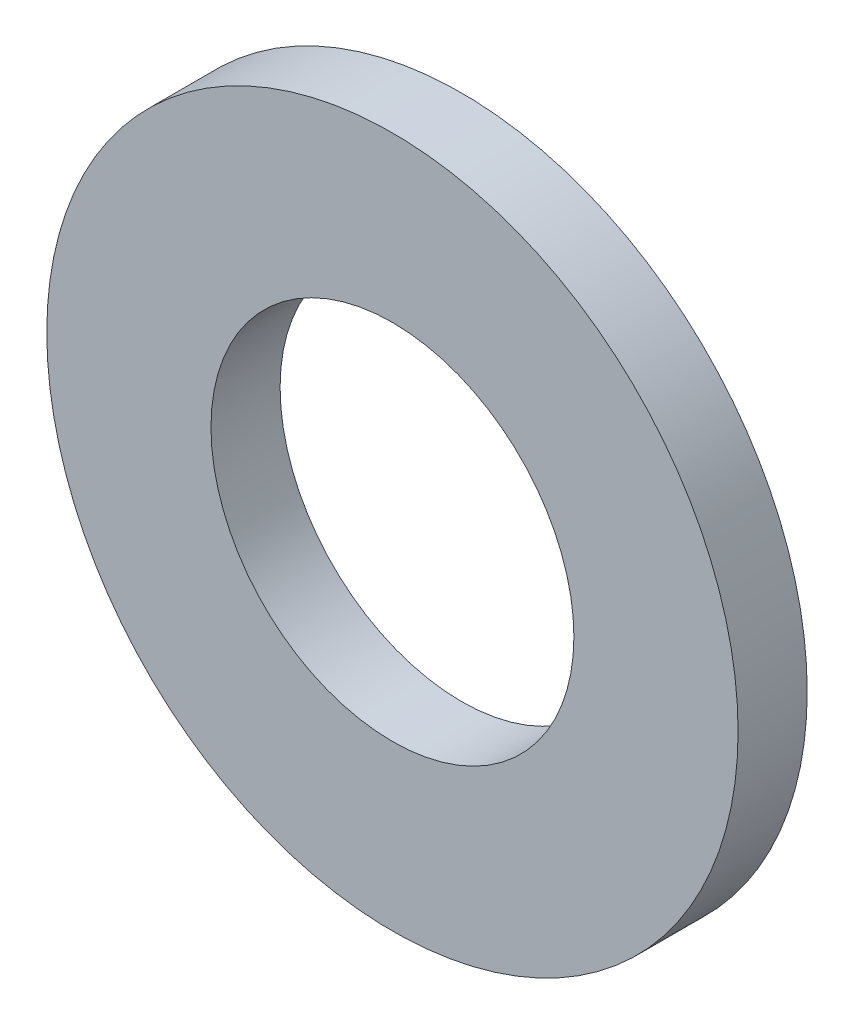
from build123d import *

# Parameters (mm, degrees)
ESQUISSE1_W = 3.8
ESQUISSE1_H = 1.6


with BuildPart() as part:
    # Esquisse1 → R_volution1 (revolve)
    with BuildSketch(Plane.XZ, mode=Mode.PRIVATE) as r_volution1_sk:
        with Locations((6.1, -0.8)):
            Rectangle(ESQUISSE1_W, ESQUISSE1_H)
    revolve(r_volution1_sk.sketch.rotate(Axis((0, 0, 0), (0, 0, -1)), 180), axis=Axis((0, 0, 0), (0, 0, -1)))


solid = part.part
